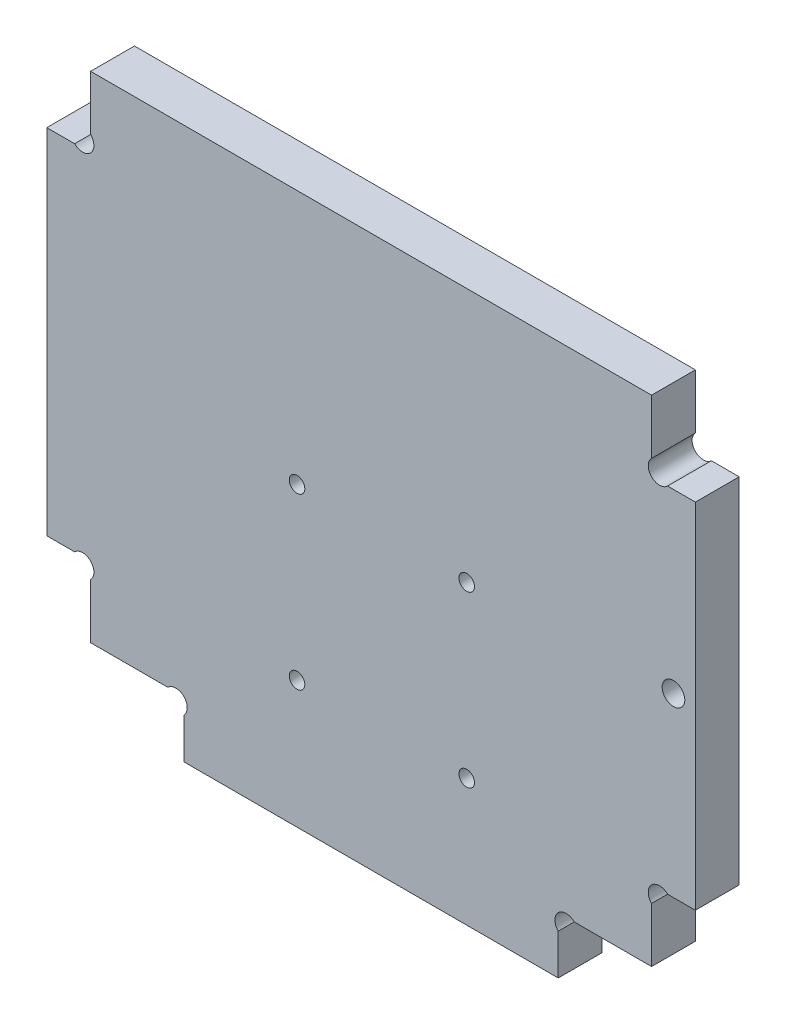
ISO-10303-21;
HEADER;
FILE_DESCRIPTION(('STEP AP214'),'2;1');
FILE_NAME('part.step','',(''),(''),'','','');
FILE_SCHEMA(('AUTOMOTIVE_DESIGN { 1 0 10303 214 1 1 1 1 }'));
ENDSEC;
DATA;
#1=APPLICATION_CONTEXT('core data for automotive mechanical design processes');
#2=APPLICATION_PROTOCOL_DEFINITION('international standard','automotive_design',2000,#1);
#3=PRODUCT_CONTEXT('',#1,'mechanical');
#4=PRODUCT('Part','Part','',(#3));
#5=PRODUCT_RELATED_PRODUCT_CATEGORY('part','',(#4));
#6=PRODUCT_DEFINITION_FORMATION('','',#4);
#7=PRODUCT_DEFINITION_CONTEXT('part definition',#1,'design');
#8=PRODUCT_DEFINITION('design','',#6,#7);
#9=PRODUCT_DEFINITION_SHAPE('','',#8);
#10=(LENGTH_UNIT() NAMED_UNIT(*) SI_UNIT(.MILLI.,.METRE.));
#11=(NAMED_UNIT(*) PLANE_ANGLE_UNIT() SI_UNIT($,.RADIAN.));
#12=(NAMED_UNIT(*) SI_UNIT($,.STERADIAN.) SOLID_ANGLE_UNIT());
#13=UNCERTAINTY_MEASURE_WITH_UNIT(LENGTH_MEASURE(1.E-05),#10,'distance_accuracy_value','');
#14=(GEOMETRIC_REPRESENTATION_CONTEXT(3) GLOBAL_UNCERTAINTY_ASSIGNED_CONTEXT((#13)) GLOBAL_UNIT_ASSIGNED_CONTEXT((#10,
#11,#12)) REPRESENTATION_CONTEXT('',''));
#15=CARTESIAN_POINT('',(0.,0.,0.));
#16=DIRECTION('',(0.,0.,1.));
#17=DIRECTION('',(1.,0.,0.));
#18=AXIS2_PLACEMENT_3D('',#15,#16,#17);
#19=CARTESIAN_POINT('',(5.06862915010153,71.1313708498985,6.2));
#20=DIRECTION('',(0.,0.,-1.));
#21=DIRECTION('',(-1.,0.,0.));
#22=AXIS2_PLACEMENT_3D('',#19,#20,#21);
#23=PLANE('',#22);
#24=CARTESIAN_POINT('',(35.4,20.,6.2));
#25=DIRECTION('',(0.,0.,-1.));
#26=DIRECTION('',(-1.,0.,0.));
#27=AXIS2_PLACEMENT_3D('',#24,#25,#26);
#28=CIRCLE('',#27,1.1);
#29=CARTESIAN_POINT('',(34.3,20.,6.2));
#30=VERTEX_POINT('',#29);
#31=EDGE_CURVE('E407',#30,#30,#28,.T.);
#32=ORIENTED_EDGE('',*,*,#31,.T.);
#33=EDGE_LOOP('',(#32));
#34=FACE_BOUND('',#33,.T.);
#35=CARTESIAN_POINT('',(35.4,44.,6.2));
#36=DIRECTION('',(0.,0.,-1.));
#37=DIRECTION('',(-1.,0.,0.));
#38=AXIS2_PLACEMENT_3D('',#35,#36,#37);
#39=CIRCLE('',#38,1.1);
#40=CARTESIAN_POINT('',(34.3,44.,6.2));
#41=VERTEX_POINT('',#40);
#42=EDGE_CURVE('E411',#41,#41,#39,.T.);
#43=ORIENTED_EDGE('',*,*,#42,.T.);
#44=EDGE_LOOP('',(#43));
#45=FACE_BOUND('',#44,.T.);
#46=CARTESIAN_POINT('',(59.4,44.,6.2));
#47=DIRECTION('',(0.,0.,-1.));
#48=DIRECTION('',(-1.,0.,0.));
#49=AXIS2_PLACEMENT_3D('',#46,#47,#48);
#50=CIRCLE('',#49,1.1);
#51=CARTESIAN_POINT('',(58.3,44.,6.2));
#52=VERTEX_POINT('',#51);
#53=EDGE_CURVE('E420',#52,#52,#50,.T.);
#54=ORIENTED_EDGE('',*,*,#53,.T.);
#55=EDGE_LOOP('',(#54));
#56=FACE_BOUND('',#55,.T.);
#57=CARTESIAN_POINT('',(59.4,20.,6.2));
#58=DIRECTION('',(0.,0.,-1.));
#59=DIRECTION('',(-1.,0.,0.));
#60=AXIS2_PLACEMENT_3D('',#57,#58,#59);
#61=CIRCLE('',#60,1.1);
#62=CARTESIAN_POINT('',(58.3,20.,6.2));
#63=VERTEX_POINT('',#62);
#64=EDGE_CURVE('E426',#63,#63,#61,.T.);
#65=ORIENTED_EDGE('',*,*,#64,.T.);
#66=EDGE_LOOP('',(#65));
#67=FACE_BOUND('',#66,.T.);
#68=DIRECTION('',(0.,-1.,0.));
#69=VECTOR('',#68,1.);
#70=CARTESIAN_POINT('',(0.,20.,6.2));
#71=LINE('',#70,#69);
#72=CARTESIAN_POINT('',(0.,70.,6.2));
#73=VERTEX_POINT('',#72);
#74=CARTESIAN_POINT('',(0.,20.,6.2));
#75=VERTEX_POINT('',#74);
#76=EDGE_CURVE('E241',#73,#75,#71,.T.);
#77=ORIENTED_EDGE('',*,*,#76,.T.);
#78=DIRECTION('',(1.,0.,0.));
#79=VECTOR('',#78,1.);
#80=CARTESIAN_POINT('',(3.93725830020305,20.,6.2));
#81=LINE('',#80,#79);
#82=CARTESIAN_POINT('',(3.93725830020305,20.,6.2));
#83=VERTEX_POINT('',#82);
#84=EDGE_CURVE('E119',#75,#83,#81,.T.);
#85=ORIENTED_EDGE('',*,*,#84,.T.);
#86=CARTESIAN_POINT('',(5.06862915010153,18.8686291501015,6.2));
#87=DIRECTION('',(0.,0.,-1.));
#88=DIRECTION('',(1.,0.,0.));
#89=AXIS2_PLACEMENT_3D('',#86,#87,#88);
#90=CIRCLE('',#89,1.6);
#91=CARTESIAN_POINT('',(6.2,17.737258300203,6.2));
#92=VERTEX_POINT('',#91);
#93=EDGE_CURVE('E298',#83,#92,#90,.T.);
#94=ORIENTED_EDGE('',*,*,#93,.T.);
#95=DIRECTION('',(0.,-1.,0.));
#96=VECTOR('',#95,1.);
#97=CARTESIAN_POINT('',(6.2,17.737258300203,6.2));
#98=LINE('',#97,#96);
#99=CARTESIAN_POINT('',(6.20000000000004,10.,6.2));
#100=VERTEX_POINT('',#99);
#101=EDGE_CURVE('E317',#92,#100,#98,.T.);
#102=ORIENTED_EDGE('',*,*,#101,.T.);
#103=DIRECTION('',(1.,0.,0.));
#104=VECTOR('',#103,1.);
#105=CARTESIAN_POINT('',(6.20000000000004,10.,6.2));
#106=LINE('',#105,#104);
#107=CARTESIAN_POINT('',(17.137258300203,10.,6.2));
#108=VERTEX_POINT('',#107);
#109=EDGE_CURVE('E314',#100,#108,#106,.T.);
#110=ORIENTED_EDGE('',*,*,#109,.T.);
#111=CARTESIAN_POINT('',(18.2686291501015,8.86862915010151,6.2));
#112=DIRECTION('',(0.,0.,-1.));
#113=DIRECTION('',(1.,0.,0.));
#114=AXIS2_PLACEMENT_3D('',#111,#112,#113);
#115=CIRCLE('',#114,1.60000000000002);
#116=CARTESIAN_POINT('',(19.4,7.73725830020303,6.2));
#117=VERTEX_POINT('',#116);
#118=EDGE_CURVE('E316',#108,#117,#115,.T.);
#119=ORIENTED_EDGE('',*,*,#118,.T.);
#120=DIRECTION('',(0.,-1.,0.));
#121=VECTOR('',#120,1.);
#122=CARTESIAN_POINT('',(19.4,7.73725830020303,6.2));
#123=LINE('',#122,#121);
#124=CARTESIAN_POINT('',(19.3999999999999,2.,6.2));
#125=VERTEX_POINT('',#124);
#126=EDGE_CURVE('E319',#117,#125,#123,.T.);
#127=ORIENTED_EDGE('',*,*,#126,.T.);
#128=DIRECTION('',(1.,0.,0.));
#129=VECTOR('',#128,1.);
#130=CARTESIAN_POINT('',(19.3999999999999,2.,6.2));
#131=LINE('',#130,#129);
#132=CARTESIAN_POINT('',(72.35,2.,6.2));
#133=VERTEX_POINT('',#132);
#134=EDGE_CURVE('E325',#125,#133,#131,.T.);
#135=ORIENTED_EDGE('',*,*,#134,.T.);
#136=DIRECTION('',(0.,1.,0.));
#137=VECTOR('',#136,1.);
#138=CARTESIAN_POINT('',(72.35,7.73725830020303,6.2));
#139=LINE('',#138,#137);
#140=CARTESIAN_POINT('',(72.35,7.73725830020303,6.2));
#141=VERTEX_POINT('',#140);
#142=EDGE_CURVE('E327',#133,#141,#139,.T.);
#143=ORIENTED_EDGE('',*,*,#142,.T.);
#144=CARTESIAN_POINT('',(73.4813708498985,8.86862915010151,6.2));
#145=DIRECTION('',(0.,0.,-1.));
#146=DIRECTION('',(-1.,0.,0.));
#147=AXIS2_PLACEMENT_3D('',#144,#145,#146);
#148=CIRCLE('',#147,1.60000000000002);
#149=CARTESIAN_POINT('',(74.612741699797,9.99999999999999,6.2));
#150=VERTEX_POINT('',#149);
#151=EDGE_CURVE('E329',#141,#150,#148,.T.);
#152=ORIENTED_EDGE('',*,*,#151,.T.);
#153=DIRECTION('',(1.,0.,0.));
#154=VECTOR('',#153,1.);
#155=CARTESIAN_POINT('',(85.55,10.,6.2));
#156=LINE('',#155,#154);
#157=CARTESIAN_POINT('',(85.55,10.,6.2));
#158=VERTEX_POINT('',#157);
#159=EDGE_CURVE('E331',#150,#158,#156,.T.);
#160=ORIENTED_EDGE('',*,*,#159,.T.);
#161=DIRECTION('',(0.,1.,0.));
#162=VECTOR('',#161,1.);
#163=CARTESIAN_POINT('',(85.55,17.737258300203,6.2));
#164=LINE('',#163,#162);
#165=CARTESIAN_POINT('',(85.55,17.737258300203,6.2));
#166=VERTEX_POINT('',#165);
#167=EDGE_CURVE('E333',#158,#166,#164,.T.);
#168=ORIENTED_EDGE('',*,*,#167,.T.);
#169=CARTESIAN_POINT('',(86.6813708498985,18.8686291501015,6.2));
#170=DIRECTION('',(0.,0.,-1.));
#171=DIRECTION('',(-1.,0.,0.));
#172=AXIS2_PLACEMENT_3D('',#169,#170,#171);
#173=CIRCLE('',#172,1.6);
#174=CARTESIAN_POINT('',(87.8127416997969,20.,6.2));
#175=VERTEX_POINT('',#174);
#176=EDGE_CURVE('E335',#166,#175,#173,.T.);
#177=ORIENTED_EDGE('',*,*,#176,.T.);
#178=DIRECTION('',(1.,0.,0.));
#179=VECTOR('',#178,1.);
#180=CARTESIAN_POINT('',(87.8127416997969,20.,6.2));
#181=LINE('',#180,#179);
#182=CARTESIAN_POINT('',(91.75,20.,6.2));
#183=VERTEX_POINT('',#182);
#184=EDGE_CURVE('E337',#175,#183,#181,.T.);
#185=ORIENTED_EDGE('',*,*,#184,.T.);
#186=DIRECTION('',(0.,1.,0.));
#187=VECTOR('',#186,1.);
#188=CARTESIAN_POINT('',(91.75,20.,6.2));
#189=LINE('',#188,#187);
#190=CARTESIAN_POINT('',(91.75,70.,6.2));
#191=VERTEX_POINT('',#190);
#192=EDGE_CURVE('E339',#183,#191,#189,.T.);
#193=ORIENTED_EDGE('',*,*,#192,.T.);
#194=DIRECTION('',(-1.,0.,0.));
#195=VECTOR('',#194,1.);
#196=CARTESIAN_POINT('',(87.8127416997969,70.,6.2));
#197=LINE('',#196,#195);
#198=CARTESIAN_POINT('',(87.8127416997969,70.,6.2));
#199=VERTEX_POINT('',#198);
#200=EDGE_CURVE('E341',#191,#199,#197,.T.);
#201=ORIENTED_EDGE('',*,*,#200,.T.);
#202=CARTESIAN_POINT('',(86.6813708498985,71.1313708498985,6.2));
#203=DIRECTION('',(0.,0.,-1.));
#204=DIRECTION('',(1.,0.,0.));
#205=AXIS2_PLACEMENT_3D('',#202,#203,#204);
#206=CIRCLE('',#205,1.6);
#207=CARTESIAN_POINT('',(85.55,72.262741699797,6.2));
#208=VERTEX_POINT('',#207);
#209=EDGE_CURVE('E343',#199,#208,#206,.T.);
#210=ORIENTED_EDGE('',*,*,#209,.T.);
#211=DIRECTION('',(0.,1.,0.));
#212=VECTOR('',#211,1.);
#213=CARTESIAN_POINT('',(85.55,72.262741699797,6.2));
#214=LINE('',#213,#212);
#215=CARTESIAN_POINT('',(85.55,80.,6.2));
#216=VERTEX_POINT('',#215);
#217=EDGE_CURVE('E345',#208,#216,#214,.T.);
#218=ORIENTED_EDGE('',*,*,#217,.T.);
#219=DIRECTION('',(-1.,0.,0.));
#220=VECTOR('',#219,1.);
#221=CARTESIAN_POINT('',(6.2,80.,6.2));
#222=LINE('',#221,#220);
#223=CARTESIAN_POINT('',(6.2,80.,6.2));
#224=VERTEX_POINT('',#223);
#225=EDGE_CURVE('E180',#216,#224,#222,.T.);
#226=ORIENTED_EDGE('',*,*,#225,.T.);
#227=DIRECTION('',(0.,-1.,0.));
#228=VECTOR('',#227,1.);
#229=CARTESIAN_POINT('',(6.2,72.262741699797,6.2));
#230=LINE('',#229,#228);
#231=CARTESIAN_POINT('',(6.2,72.262741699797,6.2));
#232=VERTEX_POINT('',#231);
#233=EDGE_CURVE('E174',#224,#232,#230,.T.);
#234=ORIENTED_EDGE('',*,*,#233,.T.);
#235=CARTESIAN_POINT('',(5.06862915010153,71.1313708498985,6.2));
#236=DIRECTION('',(0.,0.,-1.));
#237=DIRECTION('',(-1.,0.,0.));
#238=AXIS2_PLACEMENT_3D('',#235,#236,#237);
#239=CIRCLE('',#238,1.6);
#240=CARTESIAN_POINT('',(3.93725830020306,70.,6.2));
#241=VERTEX_POINT('',#240);
#242=EDGE_CURVE('E178',#232,#241,#239,.T.);
#243=ORIENTED_EDGE('',*,*,#242,.T.);
#244=DIRECTION('',(-1.,0.,0.));
#245=VECTOR('',#244,1.);
#246=CARTESIAN_POINT('',(3.93725830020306,70.,6.2));
#247=LINE('',#246,#245);
#248=EDGE_CURVE('E34',#241,#73,#247,.T.);
#249=ORIENTED_EDGE('',*,*,#248,.T.);
#250=EDGE_LOOP('',(#77,#85,#94,#102,#110,#119,#127,#135,#143,#152,#160,#168,#177,#185,#193,#201,
#210,#218,#226,#234,#243,#249));
#251=FACE_BOUND('',#250,.T.);
#252=CARTESIAN_POINT('',(88.65,45.,6.2));
#253=DIRECTION('',(0.,0.,1.));
#254=DIRECTION('',(-1.,0.,0.));
#255=AXIS2_PLACEMENT_3D('',#252,#253,#254);
#256=CIRCLE('',#255,1.6);
#257=CARTESIAN_POINT('',(87.05,45.,6.2));
#258=VERTEX_POINT('',#257);
#259=EDGE_CURVE('E202',#258,#258,#256,.T.);
#260=ORIENTED_EDGE('',*,*,#259,.F.);
#261=EDGE_LOOP('',(#260));
#262=FACE_BOUND('',#261,.T.);
#263=ADVANCED_FACE('F17',(#34,#45,#56,#67,#251,#262),#23,.F.);
#264=CARTESIAN_POINT('',(5.06862915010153,71.1313708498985,0.));
#265=DIRECTION('',(0.,0.,-1.));
#266=DIRECTION('',(-1.,0.,0.));
#267=AXIS2_PLACEMENT_3D('',#264,#265,#266);
#268=PLANE('',#267);
#269=CARTESIAN_POINT('',(35.4,20.,0.));
#270=DIRECTION('',(0.,0.,-1.));
#271=DIRECTION('',(1.,0.,0.));
#272=AXIS2_PLACEMENT_3D('',#269,#270,#271);
#273=CIRCLE('',#272,1.1);
#274=CARTESIAN_POINT('',(36.5,20.,0.));
#275=VERTEX_POINT('',#274);
#276=EDGE_CURVE('E405',#275,#275,#273,.T.);
#277=ORIENTED_EDGE('',*,*,#276,.F.);
#278=EDGE_LOOP('',(#277));
#279=FACE_BOUND('',#278,.T.);
#280=CARTESIAN_POINT('',(35.4,44.,0.));
#281=DIRECTION('',(0.,0.,-1.));
#282=DIRECTION('',(1.,0.,0.));
#283=AXIS2_PLACEMENT_3D('',#280,#281,#282);
#284=CIRCLE('',#283,1.1);
#285=CARTESIAN_POINT('',(36.5,44.,0.));
#286=VERTEX_POINT('',#285);
#287=EDGE_CURVE('E408',#286,#286,#284,.T.);
#288=ORIENTED_EDGE('',*,*,#287,.F.);
#289=EDGE_LOOP('',(#288));
#290=FACE_BOUND('',#289,.T.);
#291=CARTESIAN_POINT('',(59.4,44.,0.));
#292=DIRECTION('',(0.,0.,-1.));
#293=DIRECTION('',(-1.,0.,0.));
#294=AXIS2_PLACEMENT_3D('',#291,#292,#293);
#295=CIRCLE('',#294,1.1);
#296=CARTESIAN_POINT('',(58.3,44.,0.));
#297=VERTEX_POINT('',#296);
#298=EDGE_CURVE('E417',#297,#297,#295,.T.);
#299=ORIENTED_EDGE('',*,*,#298,.F.);
#300=EDGE_LOOP('',(#299));
#301=FACE_BOUND('',#300,.T.);
#302=CARTESIAN_POINT('',(59.4,20.,0.));
#303=DIRECTION('',(0.,0.,-1.));
#304=DIRECTION('',(-1.,0.,0.));
#305=AXIS2_PLACEMENT_3D('',#302,#303,#304);
#306=CIRCLE('',#305,1.1);
#307=CARTESIAN_POINT('',(58.3,20.,0.));
#308=VERTEX_POINT('',#307);
#309=EDGE_CURVE('E423',#308,#308,#306,.T.);
#310=ORIENTED_EDGE('',*,*,#309,.F.);
#311=EDGE_LOOP('',(#310));
#312=FACE_BOUND('',#311,.T.);
#313=DIRECTION('',(0.,-1.,0.));
#314=VECTOR('',#313,1.);
#315=CARTESIAN_POINT('',(0.,20.,0.));
#316=LINE('',#315,#314);
#317=CARTESIAN_POINT('',(0.,70.,0.));
#318=VERTEX_POINT('',#317);
#319=CARTESIAN_POINT('',(0.,20.,0.));
#320=VERTEX_POINT('',#319);
#321=EDGE_CURVE('E198',#318,#320,#316,.T.);
#322=ORIENTED_EDGE('',*,*,#321,.F.);
#323=DIRECTION('',(-1.,0.,0.));
#324=VECTOR('',#323,1.);
#325=CARTESIAN_POINT('',(3.93725830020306,70.,0.));
#326=LINE('',#325,#324);
#327=CARTESIAN_POINT('',(3.93725830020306,70.,0.));
#328=VERTEX_POINT('',#327);
#329=EDGE_CURVE('E111',#328,#318,#326,.T.);
#330=ORIENTED_EDGE('',*,*,#329,.F.);
#331=CARTESIAN_POINT('',(5.06862915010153,71.1313708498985,0.));
#332=DIRECTION('',(0.,0.,-1.));
#333=DIRECTION('',(-1.,0.,0.));
#334=AXIS2_PLACEMENT_3D('',#331,#332,#333);
#335=CIRCLE('',#334,1.6);
#336=CARTESIAN_POINT('',(6.2,72.262741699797,0.));
#337=VERTEX_POINT('',#336);
#338=EDGE_CURVE('E105',#337,#328,#335,.T.);
#339=ORIENTED_EDGE('',*,*,#338,.F.);
#340=DIRECTION('',(0.,-1.,0.));
#341=VECTOR('',#340,1.);
#342=CARTESIAN_POINT('',(6.2,72.262741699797,0.));
#343=LINE('',#342,#341);
#344=CARTESIAN_POINT('',(6.2,80.,0.));
#345=VERTEX_POINT('',#344);
#346=EDGE_CURVE('E188',#345,#337,#343,.T.);
#347=ORIENTED_EDGE('',*,*,#346,.F.);
#348=DIRECTION('',(-1.,0.,0.));
#349=VECTOR('',#348,1.);
#350=CARTESIAN_POINT('',(6.2,80.,0.));
#351=LINE('',#350,#349);
#352=CARTESIAN_POINT('',(85.55,80.,0.));
#353=VERTEX_POINT('',#352);
#354=EDGE_CURVE('E236',#353,#345,#351,.T.);
#355=ORIENTED_EDGE('',*,*,#354,.F.);
#356=DIRECTION('',(0.,1.,0.));
#357=VECTOR('',#356,1.);
#358=CARTESIAN_POINT('',(85.55,72.262741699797,0.));
#359=LINE('',#358,#357);
#360=CARTESIAN_POINT('',(85.55,72.262741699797,0.));
#361=VERTEX_POINT('',#360);
#362=EDGE_CURVE('E234',#361,#353,#359,.T.);
#363=ORIENTED_EDGE('',*,*,#362,.F.);
#364=CARTESIAN_POINT('',(86.6813708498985,71.1313708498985,0.));
#365=DIRECTION('',(0.,0.,-1.));
#366=DIRECTION('',(1.,0.,0.));
#367=AXIS2_PLACEMENT_3D('',#364,#365,#366);
#368=CIRCLE('',#367,1.6);
#369=CARTESIAN_POINT('',(87.8127416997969,70.,0.));
#370=VERTEX_POINT('',#369);
#371=EDGE_CURVE('E232',#370,#361,#368,.T.);
#372=ORIENTED_EDGE('',*,*,#371,.F.);
#373=DIRECTION('',(-1.,0.,0.));
#374=VECTOR('',#373,1.);
#375=CARTESIAN_POINT('',(87.8127416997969,70.,0.));
#376=LINE('',#375,#374);
#377=CARTESIAN_POINT('',(91.75,70.,0.));
#378=VERTEX_POINT('',#377);
#379=EDGE_CURVE('E230',#378,#370,#376,.T.);
#380=ORIENTED_EDGE('',*,*,#379,.F.);
#381=DIRECTION('',(0.,1.,0.));
#382=VECTOR('',#381,1.);
#383=CARTESIAN_POINT('',(91.75,20.,0.));
#384=LINE('',#383,#382);
#385=CARTESIAN_POINT('',(91.75,20.,0.));
#386=VERTEX_POINT('',#385);
#387=EDGE_CURVE('E228',#386,#378,#384,.T.);
#388=ORIENTED_EDGE('',*,*,#387,.F.);
#389=DIRECTION('',(1.,0.,0.));
#390=VECTOR('',#389,1.);
#391=CARTESIAN_POINT('',(87.8127416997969,20.,0.));
#392=LINE('',#391,#390);
#393=CARTESIAN_POINT('',(87.8127416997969,20.,0.));
#394=VERTEX_POINT('',#393);
#395=EDGE_CURVE('E226',#394,#386,#392,.T.);
#396=ORIENTED_EDGE('',*,*,#395,.F.);
#397=CARTESIAN_POINT('',(86.6813708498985,18.8686291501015,0.));
#398=DIRECTION('',(0.,0.,-1.));
#399=DIRECTION('',(-1.,0.,0.));
#400=AXIS2_PLACEMENT_3D('',#397,#398,#399);
#401=CIRCLE('',#400,1.6);
#402=CARTESIAN_POINT('',(85.55,17.737258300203,0.));
#403=VERTEX_POINT('',#402);
#404=EDGE_CURVE('E224',#403,#394,#401,.T.);
#405=ORIENTED_EDGE('',*,*,#404,.F.);
#406=DIRECTION('',(0.,1.,0.));
#407=VECTOR('',#406,1.);
#408=CARTESIAN_POINT('',(85.55,17.737258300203,0.));
#409=LINE('',#408,#407);
#410=CARTESIAN_POINT('',(85.55,10.,0.));
#411=VERTEX_POINT('',#410);
#412=EDGE_CURVE('E222',#411,#403,#409,.T.);
#413=ORIENTED_EDGE('',*,*,#412,.F.);
#414=DIRECTION('',(1.,0.,0.));
#415=VECTOR('',#414,1.);
#416=CARTESIAN_POINT('',(85.55,10.,0.));
#417=LINE('',#416,#415);
#418=CARTESIAN_POINT('',(74.612741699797,9.99999999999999,0.));
#419=VERTEX_POINT('',#418);
#420=EDGE_CURVE('E220',#419,#411,#417,.T.);
#421=ORIENTED_EDGE('',*,*,#420,.F.);
#422=CARTESIAN_POINT('',(73.4813708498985,8.86862915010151,0.));
#423=DIRECTION('',(0.,0.,-1.));
#424=DIRECTION('',(-1.,0.,0.));
#425=AXIS2_PLACEMENT_3D('',#422,#423,#424);
#426=CIRCLE('',#425,1.60000000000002);
#427=CARTESIAN_POINT('',(72.35,7.73725830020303,0.));
#428=VERTEX_POINT('',#427);
#429=EDGE_CURVE('E218',#428,#419,#426,.T.);
#430=ORIENTED_EDGE('',*,*,#429,.F.);
#431=DIRECTION('',(0.,1.,0.));
#432=VECTOR('',#431,1.);
#433=CARTESIAN_POINT('',(72.35,7.73725830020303,0.));
#434=LINE('',#433,#432);
#435=CARTESIAN_POINT('',(72.35,2.,0.));
#436=VERTEX_POINT('',#435);
#437=EDGE_CURVE('E216',#436,#428,#434,.T.);
#438=ORIENTED_EDGE('',*,*,#437,.F.);
#439=DIRECTION('',(1.,0.,0.));
#440=VECTOR('',#439,1.);
#441=CARTESIAN_POINT('',(19.3999999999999,2.,0.));
#442=LINE('',#441,#440);
#443=CARTESIAN_POINT('',(19.3999999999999,2.,0.));
#444=VERTEX_POINT('',#443);
#445=EDGE_CURVE('E214',#444,#436,#442,.T.);
#446=ORIENTED_EDGE('',*,*,#445,.F.);
#447=DIRECTION('',(0.,-1.,0.));
#448=VECTOR('',#447,1.);
#449=CARTESIAN_POINT('',(19.4,7.73725830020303,0.));
#450=LINE('',#449,#448);
#451=CARTESIAN_POINT('',(19.4,7.73725830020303,0.));
#452=VERTEX_POINT('',#451);
#453=EDGE_CURVE('E212',#452,#444,#450,.T.);
#454=ORIENTED_EDGE('',*,*,#453,.F.);
#455=CARTESIAN_POINT('',(18.2686291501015,8.86862915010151,0.));
#456=DIRECTION('',(0.,0.,-1.));
#457=DIRECTION('',(1.,0.,0.));
#458=AXIS2_PLACEMENT_3D('',#455,#456,#457);
#459=CIRCLE('',#458,1.60000000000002);
#460=CARTESIAN_POINT('',(17.137258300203,10.,0.));
#461=VERTEX_POINT('',#460);
#462=EDGE_CURVE('E210',#461,#452,#459,.T.);
#463=ORIENTED_EDGE('',*,*,#462,.F.);
#464=DIRECTION('',(1.,0.,0.));
#465=VECTOR('',#464,1.);
#466=CARTESIAN_POINT('',(6.20000000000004,10.,0.));
#467=LINE('',#466,#465);
#468=CARTESIAN_POINT('',(6.20000000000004,10.,0.));
#469=VERTEX_POINT('',#468);
#470=EDGE_CURVE('E208',#469,#461,#467,.T.);
#471=ORIENTED_EDGE('',*,*,#470,.F.);
#472=DIRECTION('',(0.,-1.,0.));
#473=VECTOR('',#472,1.);
#474=CARTESIAN_POINT('',(6.2,17.737258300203,0.));
#475=LINE('',#474,#473);
#476=CARTESIAN_POINT('',(6.2,17.737258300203,0.));
#477=VERTEX_POINT('',#476);
#478=EDGE_CURVE('E206',#477,#469,#475,.T.);
#479=ORIENTED_EDGE('',*,*,#478,.F.);
#480=CARTESIAN_POINT('',(5.06862915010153,18.8686291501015,0.));
#481=DIRECTION('',(0.,0.,-1.));
#482=DIRECTION('',(1.,0.,0.));
#483=AXIS2_PLACEMENT_3D('',#480,#481,#482);
#484=CIRCLE('',#483,1.6);
#485=CARTESIAN_POINT('',(3.93725830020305,20.,0.));
#486=VERTEX_POINT('',#485);
#487=EDGE_CURVE('E204',#486,#477,#484,.T.);
#488=ORIENTED_EDGE('',*,*,#487,.F.);
#489=DIRECTION('',(1.,0.,0.));
#490=VECTOR('',#489,1.);
#491=CARTESIAN_POINT('',(3.93725830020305,20.,0.));
#492=LINE('',#491,#490);
#493=EDGE_CURVE('E201',#320,#486,#492,.T.);
#494=ORIENTED_EDGE('',*,*,#493,.F.);
#495=EDGE_LOOP('',(#322,#330,#339,#347,#355,#363,#372,#380,#388,#396,#405,#413,#421,#430,#438,
#446,#454,#463,#471,#479,#488,#494));
#496=FACE_BOUND('',#495,.T.);
#497=CARTESIAN_POINT('',(88.65,45.,0.));
#498=DIRECTION('',(0.,0.,1.));
#499=DIRECTION('',(-1.,0.,0.));
#500=AXIS2_PLACEMENT_3D('',#497,#498,#499);
#501=CIRCLE('',#500,1.6);
#502=CARTESIAN_POINT('',(87.05,45.,0.));
#503=VERTEX_POINT('',#502);
#504=EDGE_CURVE('E429',#503,#503,#501,.T.);
#505=ORIENTED_EDGE('',*,*,#504,.T.);
#506=EDGE_LOOP('',(#505));
#507=FACE_BOUND('',#506,.T.);
#508=ADVANCED_FACE('F302',(#279,#290,#301,#312,#496,#507),#268,.T.);
#509=CARTESIAN_POINT('',(0.,20.,6.2));
#510=DIRECTION('',(1.,0.,0.));
#511=DIRECTION('',(0.,0.,-1.));
#512=AXIS2_PLACEMENT_3D('',#509,#510,#511);
#513=PLANE('',#512);
#514=ORIENTED_EDGE('',*,*,#321,.T.);
#515=DIRECTION('',(0.,0.,-1.));
#516=VECTOR('',#515,1.);
#517=CARTESIAN_POINT('',(0.,20.,6.2));
#518=LINE('',#517,#516);
#519=EDGE_CURVE('E11',#75,#320,#518,.T.);
#520=ORIENTED_EDGE('',*,*,#519,.F.);
#521=ORIENTED_EDGE('',*,*,#76,.F.);
#522=DIRECTION('',(0.,0.,-1.));
#523=VECTOR('',#522,1.);
#524=CARTESIAN_POINT('',(0.,70.,6.2));
#525=LINE('',#524,#523);
#526=EDGE_CURVE('E194',#73,#318,#525,.T.);
#527=ORIENTED_EDGE('',*,*,#526,.T.);
#528=EDGE_LOOP('',(#514,#520,#521,#527));
#529=FACE_BOUND('',#528,.T.);
#530=ADVANCED_FACE('F19',(#529),#513,.F.);
#531=CARTESIAN_POINT('',(3.93725830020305,20.,6.2));
#532=DIRECTION('',(0.,1.,0.));
#533=DIRECTION('',(-1.,0.,0.));
#534=AXIS2_PLACEMENT_3D('',#531,#532,#533);
#535=PLANE('',#534);
#536=ORIENTED_EDGE('',*,*,#493,.T.);
#537=DIRECTION('',(0.,0.,-1.));
#538=VECTOR('',#537,1.);
#539=CARTESIAN_POINT('',(3.93725830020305,20.,6.2));
#540=LINE('',#539,#538);
#541=EDGE_CURVE('E26',#83,#486,#540,.T.);
#542=ORIENTED_EDGE('',*,*,#541,.F.);
#543=ORIENTED_EDGE('',*,*,#84,.F.);
#544=ORIENTED_EDGE('',*,*,#519,.T.);
#545=EDGE_LOOP('',(#536,#542,#543,#544));
#546=FACE_BOUND('',#545,.T.);
#547=ADVANCED_FACE('F655',(#546),#535,.F.);
#548=CARTESIAN_POINT('',(5.06862915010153,18.8686291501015,6.2));
#549=DIRECTION('',(0.,0.,-1.));
#550=DIRECTION('',(-1.,0.,0.));
#551=AXIS2_PLACEMENT_3D('',#548,#549,#550);
#552=CYLINDRICAL_SURFACE('',#551,1.6);
#553=ORIENTED_EDGE('',*,*,#487,.T.);
#554=DIRECTION('',(0.,0.,-1.));
#555=VECTOR('',#554,1.);
#556=CARTESIAN_POINT('',(6.2,17.737258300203,6.2));
#557=LINE('',#556,#555);
#558=EDGE_CURVE('E290',#92,#477,#557,.T.);
#559=ORIENTED_EDGE('',*,*,#558,.F.);
#560=ORIENTED_EDGE('',*,*,#93,.F.);
#561=ORIENTED_EDGE('',*,*,#541,.T.);
#562=EDGE_LOOP('',(#553,#559,#560,#561));
#563=FACE_BOUND('',#562,.T.);
#564=ADVANCED_FACE('F296',(#563),#552,.F.);
#565=CARTESIAN_POINT('',(6.2,17.737258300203,6.2));
#566=DIRECTION('',(1.,0.,0.));
#567=DIRECTION('',(0.,1.,0.));
#568=AXIS2_PLACEMENT_3D('',#565,#566,#567);
#569=PLANE('',#568);
#570=ORIENTED_EDGE('',*,*,#478,.T.);
#571=DIRECTION('',(0.,0.,-1.));
#572=VECTOR('',#571,1.);
#573=CARTESIAN_POINT('',(6.20000000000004,10.,6.2));
#574=LINE('',#573,#572);
#575=EDGE_CURVE('E287',#100,#469,#574,.T.);
#576=ORIENTED_EDGE('',*,*,#575,.F.);
#577=ORIENTED_EDGE('',*,*,#101,.F.);
#578=ORIENTED_EDGE('',*,*,#558,.T.);
#579=EDGE_LOOP('',(#570,#576,#577,#578));
#580=FACE_BOUND('',#579,.T.);
#581=ADVANCED_FACE('F308',(#580),#569,.F.);
#582=CARTESIAN_POINT('',(6.20000000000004,10.,6.2));
#583=DIRECTION('',(0.,1.,0.));
#584=DIRECTION('',(0.,0.,1.));
#585=AXIS2_PLACEMENT_3D('',#582,#583,#584);
#586=PLANE('',#585);
#587=ORIENTED_EDGE('',*,*,#470,.T.);
#588=DIRECTION('',(0.,0.,-1.));
#589=VECTOR('',#588,1.);
#590=CARTESIAN_POINT('',(17.137258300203,10.,6.2));
#591=LINE('',#590,#589);
#592=EDGE_CURVE('E284',#108,#461,#591,.T.);
#593=ORIENTED_EDGE('',*,*,#592,.F.);
#594=ORIENTED_EDGE('',*,*,#109,.F.);
#595=ORIENTED_EDGE('',*,*,#575,.T.);
#596=EDGE_LOOP('',(#587,#593,#594,#595));
#597=FACE_BOUND('',#596,.T.);
#598=ADVANCED_FACE('F312',(#597),#586,.F.);
#599=CARTESIAN_POINT('',(18.2686291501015,8.86862915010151,6.2));
#600=DIRECTION('',(0.,0.,-1.));
#601=DIRECTION('',(-1.,0.,0.));
#602=AXIS2_PLACEMENT_3D('',#599,#600,#601);
#603=CYLINDRICAL_SURFACE('',#602,1.60000000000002);
#604=ORIENTED_EDGE('',*,*,#462,.T.);
#605=DIRECTION('',(0.,0.,-1.));
#606=VECTOR('',#605,1.);
#607=CARTESIAN_POINT('',(19.4,7.73725830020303,6.2));
#608=LINE('',#607,#606);
#609=EDGE_CURVE('E281',#117,#452,#608,.T.);
#610=ORIENTED_EDGE('',*,*,#609,.F.);
#611=ORIENTED_EDGE('',*,*,#118,.F.);
#612=ORIENTED_EDGE('',*,*,#592,.T.);
#613=EDGE_LOOP('',(#604,#610,#611,#612));
#614=FACE_BOUND('',#613,.T.);
#615=ADVANCED_FACE('F620',(#614),#603,.F.);
#616=CARTESIAN_POINT('',(19.4,7.73725830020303,6.2));
#617=DIRECTION('',(1.,0.,0.));
#618=DIRECTION('',(0.,1.,0.));
#619=AXIS2_PLACEMENT_3D('',#616,#617,#618);
#620=PLANE('',#619);
#621=ORIENTED_EDGE('',*,*,#453,.T.);
#622=DIRECTION('',(0.,0.,-1.));
#623=VECTOR('',#622,1.);
#624=CARTESIAN_POINT('',(19.3999999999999,2.,6.2));
#625=LINE('',#624,#623);
#626=EDGE_CURVE('E278',#125,#444,#625,.T.);
#627=ORIENTED_EDGE('',*,*,#626,.F.);
#628=ORIENTED_EDGE('',*,*,#126,.F.);
#629=ORIENTED_EDGE('',*,*,#609,.T.);
#630=EDGE_LOOP('',(#621,#627,#628,#629));
#631=FACE_BOUND('',#630,.T.);
#632=ADVANCED_FACE('F610',(#631),#620,.F.);
#633=CARTESIAN_POINT('',(19.3999999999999,2.,6.2));
#634=DIRECTION('',(0.,1.,0.));
#635=DIRECTION('',(0.,0.,1.));
#636=AXIS2_PLACEMENT_3D('',#633,#634,#635);
#637=PLANE('',#636);
#638=ORIENTED_EDGE('',*,*,#445,.T.);
#639=DIRECTION('',(0.,0.,-1.));
#640=VECTOR('',#639,1.);
#641=CARTESIAN_POINT('',(72.35,2.,6.2));
#642=LINE('',#641,#640);
#643=EDGE_CURVE('E275',#133,#436,#642,.T.);
#644=ORIENTED_EDGE('',*,*,#643,.F.);
#645=ORIENTED_EDGE('',*,*,#134,.F.);
#646=ORIENTED_EDGE('',*,*,#626,.T.);
#647=EDGE_LOOP('',(#638,#644,#645,#646));
#648=FACE_BOUND('',#647,.T.);
#649=ADVANCED_FACE('F600',(#648),#637,.F.);
#650=CARTESIAN_POINT('',(72.35,7.73725830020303,6.2));
#651=DIRECTION('',(-1.,0.,0.));
#652=DIRECTION('',(0.,0.,1.));
#653=AXIS2_PLACEMENT_3D('',#650,#651,#652);
#654=PLANE('',#653);
#655=ORIENTED_EDGE('',*,*,#437,.T.);
#656=DIRECTION('',(0.,0.,-1.));
#657=VECTOR('',#656,1.);
#658=CARTESIAN_POINT('',(72.35,7.73725830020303,6.2));
#659=LINE('',#658,#657);
#660=EDGE_CURVE('E272',#141,#428,#659,.T.);
#661=ORIENTED_EDGE('',*,*,#660,.F.);
#662=ORIENTED_EDGE('',*,*,#142,.F.);
#663=ORIENTED_EDGE('',*,*,#643,.T.);
#664=EDGE_LOOP('',(#655,#661,#662,#663));
#665=FACE_BOUND('',#664,.T.);
#666=ADVANCED_FACE('F590',(#665),#654,.F.);
#667=CARTESIAN_POINT('',(73.4813708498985,8.86862915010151,6.2));
#668=DIRECTION('',(0.,0.,-1.));
#669=DIRECTION('',(-1.,0.,0.));
#670=AXIS2_PLACEMENT_3D('',#667,#668,#669);
#671=CYLINDRICAL_SURFACE('',#670,1.60000000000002);
#672=ORIENTED_EDGE('',*,*,#429,.T.);
#673=DIRECTION('',(0.,0.,-1.));
#674=VECTOR('',#673,1.);
#675=CARTESIAN_POINT('',(74.612741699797,9.99999999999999,6.2));
#676=LINE('',#675,#674);
#677=EDGE_CURVE('E269',#150,#419,#676,.T.);
#678=ORIENTED_EDGE('',*,*,#677,.F.);
#679=ORIENTED_EDGE('',*,*,#151,.F.);
#680=ORIENTED_EDGE('',*,*,#660,.T.);
#681=EDGE_LOOP('',(#672,#678,#679,#680));
#682=FACE_BOUND('',#681,.T.);
#683=ADVANCED_FACE('F580',(#682),#671,.F.);
#684=CARTESIAN_POINT('',(85.55,10.,6.2));
#685=DIRECTION('',(0.,1.,0.));
#686=DIRECTION('',(0.,0.,1.));
#687=AXIS2_PLACEMENT_3D('',#684,#685,#686);
#688=PLANE('',#687);
#689=ORIENTED_EDGE('',*,*,#420,.T.);
#690=DIRECTION('',(0.,0.,-1.));
#691=VECTOR('',#690,1.);
#692=CARTESIAN_POINT('',(85.55,10.,6.2));
#693=LINE('',#692,#691);
#694=EDGE_CURVE('E266',#158,#411,#693,.T.);
#695=ORIENTED_EDGE('',*,*,#694,.F.);
#696=ORIENTED_EDGE('',*,*,#159,.F.);
#697=ORIENTED_EDGE('',*,*,#677,.T.);
#698=EDGE_LOOP('',(#689,#695,#696,#697));
#699=FACE_BOUND('',#698,.T.);
#700=ADVANCED_FACE('F570',(#699),#688,.F.);
#701=CARTESIAN_POINT('',(85.55,17.737258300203,6.2));
#702=DIRECTION('',(-1.,0.,0.));
#703=DIRECTION('',(0.,-1.,0.));
#704=AXIS2_PLACEMENT_3D('',#701,#702,#703);
#705=PLANE('',#704);
#706=ORIENTED_EDGE('',*,*,#412,.T.);
#707=DIRECTION('',(0.,0.,-1.));
#708=VECTOR('',#707,1.);
#709=CARTESIAN_POINT('',(85.55,17.737258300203,6.2));
#710=LINE('',#709,#708);
#711=EDGE_CURVE('E263',#166,#403,#710,.T.);
#712=ORIENTED_EDGE('',*,*,#711,.F.);
#713=ORIENTED_EDGE('',*,*,#167,.F.);
#714=ORIENTED_EDGE('',*,*,#694,.T.);
#715=EDGE_LOOP('',(#706,#712,#713,#714));
#716=FACE_BOUND('',#715,.T.);
#717=ADVANCED_FACE('F560',(#716),#705,.F.);
#718=CARTESIAN_POINT('',(86.6813708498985,18.8686291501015,6.2));
#719=DIRECTION('',(0.,0.,-1.));
#720=DIRECTION('',(-1.,0.,0.));
#721=AXIS2_PLACEMENT_3D('',#718,#719,#720);
#722=CYLINDRICAL_SURFACE('',#721,1.6);
#723=ORIENTED_EDGE('',*,*,#404,.T.);
#724=DIRECTION('',(0.,0.,-1.));
#725=VECTOR('',#724,1.);
#726=CARTESIAN_POINT('',(87.8127416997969,20.,6.2));
#727=LINE('',#726,#725);
#728=EDGE_CURVE('E260',#175,#394,#727,.T.);
#729=ORIENTED_EDGE('',*,*,#728,.F.);
#730=ORIENTED_EDGE('',*,*,#176,.F.);
#731=ORIENTED_EDGE('',*,*,#711,.T.);
#732=EDGE_LOOP('',(#723,#729,#730,#731));
#733=FACE_BOUND('',#732,.T.);
#734=ADVANCED_FACE('F550',(#733),#722,.F.);
#735=CARTESIAN_POINT('',(87.8127416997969,20.,6.2));
#736=DIRECTION('',(0.,1.,0.));
#737=DIRECTION('',(-1.,0.,0.));
#738=AXIS2_PLACEMENT_3D('',#735,#736,#737);
#739=PLANE('',#738);
#740=ORIENTED_EDGE('',*,*,#395,.T.);
#741=DIRECTION('',(0.,0.,-1.));
#742=VECTOR('',#741,1.);
#743=CARTESIAN_POINT('',(91.75,20.,6.2));
#744=LINE('',#743,#742);
#745=EDGE_CURVE('E257',#183,#386,#744,.T.);
#746=ORIENTED_EDGE('',*,*,#745,.F.);
#747=ORIENTED_EDGE('',*,*,#184,.F.);
#748=ORIENTED_EDGE('',*,*,#728,.T.);
#749=EDGE_LOOP('',(#740,#746,#747,#748));
#750=FACE_BOUND('',#749,.T.);
#751=ADVANCED_FACE('F540',(#750),#739,.F.);
#752=CARTESIAN_POINT('',(91.75,20.,6.2));
#753=DIRECTION('',(-1.,0.,0.));
#754=DIRECTION('',(0.,0.,1.));
#755=AXIS2_PLACEMENT_3D('',#752,#753,#754);
#756=PLANE('',#755);
#757=ORIENTED_EDGE('',*,*,#387,.T.);
#758=DIRECTION('',(0.,0.,-1.));
#759=VECTOR('',#758,1.);
#760=CARTESIAN_POINT('',(91.75,70.,6.2));
#761=LINE('',#760,#759);
#762=EDGE_CURVE('E254',#191,#378,#761,.T.);
#763=ORIENTED_EDGE('',*,*,#762,.F.);
#764=ORIENTED_EDGE('',*,*,#192,.F.);
#765=ORIENTED_EDGE('',*,*,#745,.T.);
#766=EDGE_LOOP('',(#757,#763,#764,#765));
#767=FACE_BOUND('',#766,.T.);
#768=ADVANCED_FACE('F530',(#767),#756,.F.);
#769=CARTESIAN_POINT('',(87.8127416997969,70.,6.2));
#770=DIRECTION('',(0.,-1.,0.));
#771=DIRECTION('',(0.,0.,-1.));
#772=AXIS2_PLACEMENT_3D('',#769,#770,#771);
#773=PLANE('',#772);
#774=ORIENTED_EDGE('',*,*,#379,.T.);
#775=DIRECTION('',(0.,0.,-1.));
#776=VECTOR('',#775,1.);
#777=CARTESIAN_POINT('',(87.8127416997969,70.,6.2));
#778=LINE('',#777,#776);
#779=EDGE_CURVE('E251',#199,#370,#778,.T.);
#780=ORIENTED_EDGE('',*,*,#779,.F.);
#781=ORIENTED_EDGE('',*,*,#200,.F.);
#782=ORIENTED_EDGE('',*,*,#762,.T.);
#783=EDGE_LOOP('',(#774,#780,#781,#782));
#784=FACE_BOUND('',#783,.T.);
#785=ADVANCED_FACE('F520',(#784),#773,.F.);
#786=CARTESIAN_POINT('',(86.6813708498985,71.1313708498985,6.2));
#787=DIRECTION('',(0.,0.,-1.));
#788=DIRECTION('',(-1.,0.,0.));
#789=AXIS2_PLACEMENT_3D('',#786,#787,#788);
#790=CYLINDRICAL_SURFACE('',#789,1.6);
#791=ORIENTED_EDGE('',*,*,#371,.T.);
#792=DIRECTION('',(0.,0.,-1.));
#793=VECTOR('',#792,1.);
#794=CARTESIAN_POINT('',(85.55,72.262741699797,6.2));
#795=LINE('',#794,#793);
#796=EDGE_CURVE('E248',#208,#361,#795,.T.);
#797=ORIENTED_EDGE('',*,*,#796,.F.);
#798=ORIENTED_EDGE('',*,*,#209,.F.);
#799=ORIENTED_EDGE('',*,*,#779,.T.);
#800=EDGE_LOOP('',(#791,#797,#798,#799));
#801=FACE_BOUND('',#800,.T.);
#802=ADVANCED_FACE('F511',(#801),#790,.F.);
#803=CARTESIAN_POINT('',(85.55,72.262741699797,6.2));
#804=DIRECTION('',(-1.,0.,0.));
#805=DIRECTION('',(0.,0.,1.));
#806=AXIS2_PLACEMENT_3D('',#803,#804,#805);
#807=PLANE('',#806);
#808=ORIENTED_EDGE('',*,*,#362,.T.);
#809=DIRECTION('',(0.,0.,-1.));
#810=VECTOR('',#809,1.);
#811=CARTESIAN_POINT('',(85.55,80.,6.2));
#812=LINE('',#811,#810);
#813=EDGE_CURVE('E245',#216,#353,#812,.T.);
#814=ORIENTED_EDGE('',*,*,#813,.F.);
#815=ORIENTED_EDGE('',*,*,#217,.F.);
#816=ORIENTED_EDGE('',*,*,#796,.T.);
#817=EDGE_LOOP('',(#808,#814,#815,#816));
#818=FACE_BOUND('',#817,.T.);
#819=ADVANCED_FACE('F351',(#818),#807,.F.);
#820=CARTESIAN_POINT('',(6.2,80.,6.2));
#821=DIRECTION('',(0.,-1.,0.));
#822=DIRECTION('',(0.,0.,-1.));
#823=AXIS2_PLACEMENT_3D('',#820,#821,#822);
#824=PLANE('',#823);
#825=ORIENTED_EDGE('',*,*,#354,.T.);
#826=DIRECTION('',(0.,0.,-1.));
#827=VECTOR('',#826,1.);
#828=CARTESIAN_POINT('',(6.2,80.,6.2));
#829=LINE('',#828,#827);
#830=EDGE_CURVE('E189',#224,#345,#829,.T.);
#831=ORIENTED_EDGE('',*,*,#830,.F.);
#832=ORIENTED_EDGE('',*,*,#225,.F.);
#833=ORIENTED_EDGE('',*,*,#813,.T.);
#834=EDGE_LOOP('',(#825,#831,#832,#833));
#835=FACE_BOUND('',#834,.T.);
#836=ADVANCED_FACE('F355',(#835),#824,.F.);
#837=CARTESIAN_POINT('',(6.2,72.262741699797,6.2));
#838=DIRECTION('',(1.,0.,0.));
#839=DIRECTION('',(0.,1.,0.));
#840=AXIS2_PLACEMENT_3D('',#837,#838,#839);
#841=PLANE('',#840);
#842=ORIENTED_EDGE('',*,*,#346,.T.);
#843=DIRECTION('',(0.,0.,-1.));
#844=VECTOR('',#843,1.);
#845=CARTESIAN_POINT('',(6.2,72.262741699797,6.2));
#846=LINE('',#845,#844);
#847=EDGE_CURVE('E185',#232,#337,#846,.T.);
#848=ORIENTED_EDGE('',*,*,#847,.F.);
#849=ORIENTED_EDGE('',*,*,#233,.F.);
#850=ORIENTED_EDGE('',*,*,#830,.T.);
#851=EDGE_LOOP('',(#842,#848,#849,#850));
#852=FACE_BOUND('',#851,.T.);
#853=ADVANCED_FACE('F186',(#852),#841,.F.);
#854=CARTESIAN_POINT('',(5.06862915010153,71.1313708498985,6.2));
#855=DIRECTION('',(0.,0.,-1.));
#856=DIRECTION('',(-1.,0.,0.));
#857=AXIS2_PLACEMENT_3D('',#854,#855,#856);
#858=CYLINDRICAL_SURFACE('',#857,1.6);
#859=ORIENTED_EDGE('',*,*,#338,.T.);
#860=DIRECTION('',(0.,0.,-1.));
#861=VECTOR('',#860,1.);
#862=CARTESIAN_POINT('',(3.93725830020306,70.,6.2));
#863=LINE('',#862,#861);
#864=EDGE_CURVE('E190',#241,#328,#863,.T.);
#865=ORIENTED_EDGE('',*,*,#864,.F.);
#866=ORIENTED_EDGE('',*,*,#242,.F.);
#867=ORIENTED_EDGE('',*,*,#847,.T.);
#868=EDGE_LOOP('',(#859,#865,#866,#867));
#869=FACE_BOUND('',#868,.T.);
#870=ADVANCED_FACE('F192',(#869),#858,.F.);
#871=CARTESIAN_POINT('',(3.93725830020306,70.,6.2));
#872=DIRECTION('',(0.,-1.,0.));
#873=DIRECTION('',(0.,0.,-1.));
#874=AXIS2_PLACEMENT_3D('',#871,#872,#873);
#875=PLANE('',#874);
#876=ORIENTED_EDGE('',*,*,#329,.T.);
#877=ORIENTED_EDGE('',*,*,#526,.F.);
#878=ORIENTED_EDGE('',*,*,#248,.F.);
#879=ORIENTED_EDGE('',*,*,#864,.T.);
#880=EDGE_LOOP('',(#876,#877,#878,#879));
#881=FACE_BOUND('',#880,.T.);
#882=ADVANCED_FACE('F359',(#881),#875,.F.);
#883=CARTESIAN_POINT('',(88.65,45.,6.2));
#884=DIRECTION('',(0.,0.,-1.));
#885=DIRECTION('',(-1.,0.,0.));
#886=AXIS2_PLACEMENT_3D('',#883,#884,#885);
#887=CYLINDRICAL_SURFACE('',#886,1.6);
#888=CARTESIAN_POINT('',(87.05,45.,6.2));
#889=CARTESIAN_POINT('',(87.05,45.,6.13541666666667));
#890=CARTESIAN_POINT('',(87.05,45.,6.07083333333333));
#891=CARTESIAN_POINT('',(87.05,45.,5.94166666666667));
#892=CARTESIAN_POINT('',(87.05,45.,5.87708333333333));
#893=CARTESIAN_POINT('',(87.05,45.,5.74791666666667));
#894=CARTESIAN_POINT('',(87.05,45.,5.68333333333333));
#895=CARTESIAN_POINT('',(87.05,45.,5.55416666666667));
#896=CARTESIAN_POINT('',(87.05,45.,5.48958333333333));
#897=CARTESIAN_POINT('',(87.05,45.,5.36041666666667));
#898=CARTESIAN_POINT('',(87.05,45.,5.29583333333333));
#899=CARTESIAN_POINT('',(87.05,45.,5.16666666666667));
#900=CARTESIAN_POINT('',(87.05,45.,5.10208333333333));
#901=CARTESIAN_POINT('',(87.05,45.,4.97291666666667));
#902=CARTESIAN_POINT('',(87.05,45.,4.90833333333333));
#903=CARTESIAN_POINT('',(87.05,45.,4.77916666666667));
#904=CARTESIAN_POINT('',(87.05,45.,4.71458333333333));
#905=CARTESIAN_POINT('',(87.05,45.,4.58541666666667));
#906=CARTESIAN_POINT('',(87.05,45.,4.52083333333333));
#907=CARTESIAN_POINT('',(87.05,45.,4.39166666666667));
#908=CARTESIAN_POINT('',(87.05,45.,4.32708333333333));
#909=CARTESIAN_POINT('',(87.05,45.,4.19791666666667));
#910=CARTESIAN_POINT('',(87.05,45.,4.13333333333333));
#911=CARTESIAN_POINT('',(87.05,45.,4.00416666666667));
#912=CARTESIAN_POINT('',(87.05,45.,3.93958333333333));
#913=CARTESIAN_POINT('',(87.05,45.,3.81041666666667));
#914=CARTESIAN_POINT('',(87.05,45.,3.74583333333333));
#915=CARTESIAN_POINT('',(87.05,45.,3.61666666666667));
#916=CARTESIAN_POINT('',(87.05,45.,3.55208333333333));
#917=CARTESIAN_POINT('',(87.05,45.,3.42291666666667));
#918=CARTESIAN_POINT('',(87.05,45.,3.35833333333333));
#919=CARTESIAN_POINT('',(87.05,45.,3.22916666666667));
#920=CARTESIAN_POINT('',(87.05,45.,3.16458333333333));
#921=CARTESIAN_POINT('',(87.05,45.,3.03541666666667));
#922=CARTESIAN_POINT('',(87.05,45.,2.97083333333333));
#923=CARTESIAN_POINT('',(87.05,45.,2.84166666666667));
#924=CARTESIAN_POINT('',(87.05,45.,2.77708333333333));
#925=CARTESIAN_POINT('',(87.05,45.,2.64791666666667));
#926=CARTESIAN_POINT('',(87.05,45.,2.58333333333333));
#927=CARTESIAN_POINT('',(87.05,45.,2.45416666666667));
#928=CARTESIAN_POINT('',(87.05,45.,2.38958333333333));
#929=CARTESIAN_POINT('',(87.05,45.,2.26041666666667));
#930=CARTESIAN_POINT('',(87.05,45.,2.19583333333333));
#931=CARTESIAN_POINT('',(87.05,45.,2.06666666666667));
#932=CARTESIAN_POINT('',(87.05,45.,2.00208333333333));
#933=CARTESIAN_POINT('',(87.05,45.,1.87291666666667));
#934=CARTESIAN_POINT('',(87.05,45.,1.80833333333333));
#935=CARTESIAN_POINT('',(87.05,45.,1.67916666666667));
#936=CARTESIAN_POINT('',(87.05,45.,1.61458333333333));
#937=CARTESIAN_POINT('',(87.05,45.,1.48541666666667));
#938=CARTESIAN_POINT('',(87.05,45.,1.42083333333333));
#939=CARTESIAN_POINT('',(87.05,45.,1.29166666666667));
#940=CARTESIAN_POINT('',(87.05,45.,1.22708333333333));
#941=CARTESIAN_POINT('',(87.05,45.,1.09791666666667));
#942=CARTESIAN_POINT('',(87.05,45.,1.03333333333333));
#943=CARTESIAN_POINT('',(87.05,45.,0.904166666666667));
#944=CARTESIAN_POINT('',(87.05,45.,0.839583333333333));
#945=CARTESIAN_POINT('',(87.05,45.,0.710416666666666));
#946=CARTESIAN_POINT('',(87.05,45.,0.645833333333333));
#947=CARTESIAN_POINT('',(87.05,45.,0.516666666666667));
#948=CARTESIAN_POINT('',(87.05,45.,0.452083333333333));
#949=CARTESIAN_POINT('',(87.05,45.,0.322916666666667));
#950=CARTESIAN_POINT('',(87.05,45.,0.258333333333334));
#951=CARTESIAN_POINT('',(87.05,45.,0.129166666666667));
#952=CARTESIAN_POINT('',(87.05,45.,0.0645833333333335));
#953=CARTESIAN_POINT('',(87.05,45.,0.));
#954=B_SPLINE_CURVE_WITH_KNOTS('',3,(#888,#889,#890,#891,#892,#893,#894,#895,#896,#897,#898,
#899,#900,#901,#902,#903,#904,#905,#906,#907,#908,#909,#910,#911,#912,#913,#914,#915,#916,#917,
#918,#919,#920,#921,#922,#923,#924,#925,#926,#927,#928,#929,#930,#931,#932,#933,#934,#935,#936,
#937,#938,#939,#940,#941,#942,#943,#944,#945,#946,#947,#948,#949,#950,#951,#952,#953),
.UNSPECIFIED.,.F.,.F.,(4,2,2,2,2,2,2,2,2,2,2,2,2,2,2,2,2,2,2,2,2,2,2,2,2,2,2,2,2,2,2,2,4),(0.,
0.193749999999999,0.3875,0.581249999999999,0.775,0.968749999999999,1.1625,1.35625,1.55,1.74375,
1.9375,2.13125,2.325,2.51875,2.7125,2.90625,3.1,3.29375,3.4875,3.68125,3.875,4.06875,4.2625,
4.45625,4.65,4.84375,5.0375,5.23125,5.425,5.61875,5.8125,6.00625,6.2),.UNSPECIFIED.);
#955=EDGE_CURVE('BSEAM361',#258,#503,#954,.T.);
#956=ORIENTED_EDGE('',*,*,#259,.T.);
#957=ORIENTED_EDGE('',*,*,#504,.F.);
#958=ORIENTED_EDGE('',*,*,#955,.T.);
#959=ORIENTED_EDGE('',*,*,#955,.F.);
#960=EDGE_LOOP('',(#956,#958,#957,#959));
#961=FACE_BOUND('',#960,.T.);
#962=ADVANCED_FACE('F361',(#961),#887,.F.);
#963=CARTESIAN_POINT('',(59.4,20.,7.));
#964=DIRECTION('',(0.,0.,-1.));
#965=DIRECTION('',(-1.,0.,0.));
#966=AXIS2_PLACEMENT_3D('',#963,#964,#965);
#967=CYLINDRICAL_SURFACE('',#966,1.1);
#968=ORIENTED_EDGE('',*,*,#309,.T.);
#969=EDGE_LOOP('',(#968));
#970=FACE_BOUND('',#969,.T.);
#971=ORIENTED_EDGE('',*,*,#64,.F.);
#972=EDGE_LOOP('',(#971));
#973=FACE_BOUND('',#972,.T.);
#974=ADVANCED_FACE('F369',(#970,#973),#967,.F.);
#975=CARTESIAN_POINT('',(59.4,44.,7.));
#976=DIRECTION('',(0.,0.,-1.));
#977=DIRECTION('',(-1.,0.,0.));
#978=AXIS2_PLACEMENT_3D('',#975,#976,#977);
#979=CYLINDRICAL_SURFACE('',#978,1.1);
#980=ORIENTED_EDGE('',*,*,#298,.T.);
#981=EDGE_LOOP('',(#980));
#982=FACE_BOUND('',#981,.T.);
#983=ORIENTED_EDGE('',*,*,#53,.F.);
#984=EDGE_LOOP('',(#983));
#985=FACE_BOUND('',#984,.T.);
#986=ADVANCED_FACE('F387',(#982,#985),#979,.F.);
#987=CARTESIAN_POINT('',(35.4,44.,7.));
#988=DIRECTION('',(0.,0.,-1.));
#989=DIRECTION('',(-1.,0.,0.));
#990=AXIS2_PLACEMENT_3D('',#987,#988,#989);
#991=CYLINDRICAL_SURFACE('',#990,1.1);
#992=ORIENTED_EDGE('',*,*,#287,.T.);
#993=EDGE_LOOP('',(#992));
#994=FACE_BOUND('',#993,.T.);
#995=ORIENTED_EDGE('',*,*,#42,.F.);
#996=EDGE_LOOP('',(#995));
#997=FACE_BOUND('',#996,.T.);
#998=ADVANCED_FACE('F391',(#994,#997),#991,.F.);
#999=CARTESIAN_POINT('',(35.4,20.,7.));
#1000=DIRECTION('',(0.,0.,-1.));
#1001=DIRECTION('',(-1.,0.,0.));
#1002=AXIS2_PLACEMENT_3D('',#999,#1000,#1001);
#1003=CYLINDRICAL_SURFACE('',#1002,1.1);
#1004=ORIENTED_EDGE('',*,*,#276,.T.);
#1005=EDGE_LOOP('',(#1004));
#1006=FACE_BOUND('',#1005,.T.);
#1007=ORIENTED_EDGE('',*,*,#31,.F.);
#1008=EDGE_LOOP('',(#1007));
#1009=FACE_BOUND('',#1008,.T.);
#1010=ADVANCED_FACE('F395',(#1006,#1009),#1003,.F.);
#1011=CLOSED_SHELL('',(#263,#508,#530,#547,#564,#581,#598,#615,#632,#649,#666,#683,#700,#717,
#734,#751,#768,#785,#802,#819,#836,#853,#870,#882,#962,#974,#986,#998,#1010));
#1012=MANIFOLD_SOLID_BREP('B1',#1011);
#1013=ADVANCED_BREP_SHAPE_REPRESENTATION('',(#18,#1012),#14);
#1014=SHAPE_DEFINITION_REPRESENTATION(#9,#1013);
ENDSEC;
END-ISO-10303-21;
